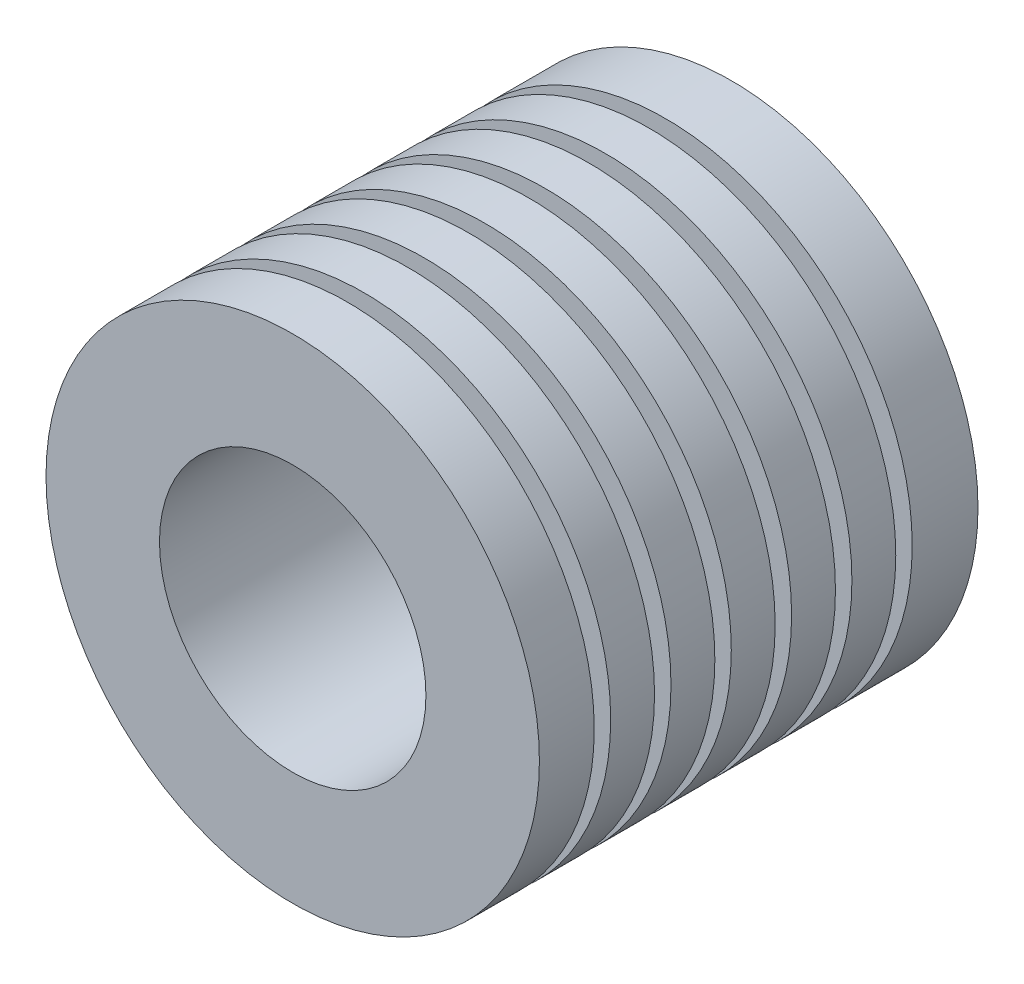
ISO-10303-21;
HEADER;
FILE_DESCRIPTION(('STEP AP214'),'2;1');
FILE_NAME('part.step','',(''),(''),'','','');
FILE_SCHEMA(('AUTOMOTIVE_DESIGN { 1 0 10303 214 1 1 1 1 }'));
ENDSEC;
DATA;
#1=APPLICATION_CONTEXT('core data for automotive mechanical design processes');
#2=APPLICATION_PROTOCOL_DEFINITION('international standard','automotive_design',2000,#1);
#3=PRODUCT_CONTEXT('',#1,'mechanical');
#4=PRODUCT('Part','Part','',(#3));
#5=PRODUCT_RELATED_PRODUCT_CATEGORY('part','',(#4));
#6=PRODUCT_DEFINITION_FORMATION('','',#4);
#7=PRODUCT_DEFINITION_CONTEXT('part definition',#1,'design');
#8=PRODUCT_DEFINITION('design','',#6,#7);
#9=PRODUCT_DEFINITION_SHAPE('','',#8);
#10=(LENGTH_UNIT() NAMED_UNIT(*) SI_UNIT(.MILLI.,.METRE.));
#11=(NAMED_UNIT(*) PLANE_ANGLE_UNIT() SI_UNIT($,.RADIAN.));
#12=(NAMED_UNIT(*) SI_UNIT($,.STERADIAN.) SOLID_ANGLE_UNIT());
#13=UNCERTAINTY_MEASURE_WITH_UNIT(LENGTH_MEASURE(1.E-05),#10,'distance_accuracy_value','');
#14=(GEOMETRIC_REPRESENTATION_CONTEXT(3) GLOBAL_UNCERTAINTY_ASSIGNED_CONTEXT((#13)) GLOBAL_UNIT_ASSIGNED_CONTEXT((#10,
#11,#12)) REPRESENTATION_CONTEXT('',''));
#15=CARTESIAN_POINT('',(0.,0.,0.));
#16=DIRECTION('',(0.,0.,1.));
#17=DIRECTION('',(1.,0.,0.));
#18=AXIS2_PLACEMENT_3D('',#15,#16,#17);
#19=CARTESIAN_POINT('',(0.,0.,40.));
#20=DIRECTION('',(0.,0.,-1.));
#21=DIRECTION('',(-1.,0.,0.));
#22=AXIS2_PLACEMENT_3D('',#19,#20,#21);
#23=CYLINDRICAL_SURFACE('',#22,22.5);
#24=CARTESIAN_POINT('',(0.,0.,7.50000000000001));
#25=DIRECTION('',(0.,0.,1.));
#26=DIRECTION('',(1.,0.,0.));
#27=AXIS2_PLACEMENT_3D('',#24,#25,#26);
#28=CIRCLE('',#27,22.5);
#29=CARTESIAN_POINT('',(22.5,0.,7.50000000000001));
#30=VERTEX_POINT('',#29);
#31=EDGE_CURVE('E38',#30,#30,#28,.T.);
#32=ORIENTED_EDGE('',*,*,#31,.T.);
#33=EDGE_LOOP('',(#32));
#34=FACE_BOUND('',#33,.T.);
#35=CARTESIAN_POINT('',(0.,0.,11.5));
#36=DIRECTION('',(0.,0.,-1.));
#37=DIRECTION('',(-1.,0.,0.));
#38=AXIS2_PLACEMENT_3D('',#35,#36,#37);
#39=CIRCLE('',#38,22.5);
#40=CARTESIAN_POINT('',(-22.5,0.,11.5));
#41=VERTEX_POINT('',#40);
#42=EDGE_CURVE('E84',#41,#41,#39,.T.);
#43=ORIENTED_EDGE('',*,*,#42,.T.);
#44=EDGE_LOOP('',(#43));
#45=FACE_BOUND('',#44,.T.);
#46=ADVANCED_FACE('F34',(#34,#45),#23,.T.);
#47=CARTESIAN_POINT('',(0.,0.,13.));
#48=DIRECTION('',(0.,0.,1.));
#49=DIRECTION('',(1.,0.,0.));
#50=AXIS2_PLACEMENT_3D('',#47,#48,#49);
#51=CIRCLE('',#50,22.5);
#52=CARTESIAN_POINT('',(22.5,0.,13.));
#53=VERTEX_POINT('',#52);
#54=EDGE_CURVE('E87',#53,#53,#51,.T.);
#55=ORIENTED_EDGE('',*,*,#54,.T.);
#56=EDGE_LOOP('',(#55));
#57=FACE_BOUND('',#56,.T.);
#58=CARTESIAN_POINT('',(0.,0.,17.));
#59=DIRECTION('',(0.,0.,-1.));
#60=DIRECTION('',(-1.,0.,0.));
#61=AXIS2_PLACEMENT_3D('',#58,#59,#60);
#62=CIRCLE('',#61,22.5);
#63=CARTESIAN_POINT('',(-22.5,0.,17.));
#64=VERTEX_POINT('',#63);
#65=EDGE_CURVE('E76',#64,#64,#62,.T.);
#66=ORIENTED_EDGE('',*,*,#65,.T.);
#67=EDGE_LOOP('',(#66));
#68=FACE_BOUND('',#67,.T.);
#69=ADVANCED_FACE('F151',(#57,#68),#23,.T.);
#70=CARTESIAN_POINT('',(0.,0.,18.5));
#71=DIRECTION('',(0.,0.,1.));
#72=DIRECTION('',(1.,0.,0.));
#73=AXIS2_PLACEMENT_3D('',#70,#71,#72);
#74=CIRCLE('',#73,22.5);
#75=CARTESIAN_POINT('',(22.5,0.,18.5));
#76=VERTEX_POINT('',#75);
#77=EDGE_CURVE('E79',#76,#76,#74,.T.);
#78=ORIENTED_EDGE('',*,*,#77,.T.);
#79=EDGE_LOOP('',(#78));
#80=FACE_BOUND('',#79,.T.);
#81=CARTESIAN_POINT('',(0.,0.,22.5));
#82=DIRECTION('',(0.,0.,-1.));
#83=DIRECTION('',(-1.,0.,0.));
#84=AXIS2_PLACEMENT_3D('',#81,#82,#83);
#85=CIRCLE('',#84,22.5);
#86=CARTESIAN_POINT('',(-22.5,0.,22.5));
#87=VERTEX_POINT('',#86);
#88=EDGE_CURVE('E68',#87,#87,#85,.T.);
#89=ORIENTED_EDGE('',*,*,#88,.T.);
#90=EDGE_LOOP('',(#89));
#91=FACE_BOUND('',#90,.T.);
#92=ADVANCED_FACE('F156',(#80,#91),#23,.T.);
#93=CARTESIAN_POINT('',(0.,0.,24.));
#94=DIRECTION('',(0.,0.,1.));
#95=DIRECTION('',(1.,0.,0.));
#96=AXIS2_PLACEMENT_3D('',#93,#94,#95);
#97=CIRCLE('',#96,22.5);
#98=CARTESIAN_POINT('',(22.5,0.,24.));
#99=VERTEX_POINT('',#98);
#100=EDGE_CURVE('E71',#99,#99,#97,.T.);
#101=ORIENTED_EDGE('',*,*,#100,.T.);
#102=EDGE_LOOP('',(#101));
#103=FACE_BOUND('',#102,.T.);
#104=CARTESIAN_POINT('',(0.,0.,28.));
#105=DIRECTION('',(0.,0.,-1.));
#106=DIRECTION('',(-1.,0.,0.));
#107=AXIS2_PLACEMENT_3D('',#104,#105,#106);
#108=CIRCLE('',#107,22.5);
#109=CARTESIAN_POINT('',(-22.5,0.,28.));
#110=VERTEX_POINT('',#109);
#111=EDGE_CURVE('E60',#110,#110,#108,.T.);
#112=ORIENTED_EDGE('',*,*,#111,.T.);
#113=EDGE_LOOP('',(#112));
#114=FACE_BOUND('',#113,.T.);
#115=ADVANCED_FACE('F173',(#103,#114),#23,.T.);
#116=CARTESIAN_POINT('',(0.,0.,29.5));
#117=DIRECTION('',(0.,0.,1.));
#118=DIRECTION('',(1.,0.,0.));
#119=AXIS2_PLACEMENT_3D('',#116,#117,#118);
#120=CIRCLE('',#119,22.5);
#121=CARTESIAN_POINT('',(22.5,0.,29.5));
#122=VERTEX_POINT('',#121);
#123=EDGE_CURVE('E63',#122,#122,#120,.T.);
#124=ORIENTED_EDGE('',*,*,#123,.T.);
#125=EDGE_LOOP('',(#124));
#126=FACE_BOUND('',#125,.T.);
#127=CARTESIAN_POINT('',(0.,0.,33.5));
#128=DIRECTION('',(0.,0.,-1.));
#129=DIRECTION('',(-1.,0.,0.));
#130=AXIS2_PLACEMENT_3D('',#127,#128,#129);
#131=CIRCLE('',#130,22.5);
#132=CARTESIAN_POINT('',(-22.5,0.,33.5));
#133=VERTEX_POINT('',#132);
#134=EDGE_CURVE('E52',#133,#133,#131,.T.);
#135=ORIENTED_EDGE('',*,*,#134,.T.);
#136=EDGE_LOOP('',(#135));
#137=FACE_BOUND('',#136,.T.);
#138=ADVANCED_FACE('F166',(#126,#137),#23,.T.);
#139=CARTESIAN_POINT('',(0.,0.,35.));
#140=DIRECTION('',(0.,0.,1.));
#141=DIRECTION('',(1.,0.,0.));
#142=AXIS2_PLACEMENT_3D('',#139,#140,#141);
#143=CIRCLE('',#142,22.5);
#144=CARTESIAN_POINT('',(22.5,0.,35.));
#145=VERTEX_POINT('',#144);
#146=EDGE_CURVE('E55',#145,#145,#143,.T.);
#147=ORIENTED_EDGE('',*,*,#146,.T.);
#148=EDGE_LOOP('',(#147));
#149=FACE_BOUND('',#148,.T.);
#150=CARTESIAN_POINT('',(0.,0.,40.));
#151=DIRECTION('',(0.,0.,1.));
#152=DIRECTION('',(1.,0.,0.));
#153=AXIS2_PLACEMENT_3D('',#150,#151,#152);
#154=CIRCLE('',#153,22.5);
#155=CARTESIAN_POINT('',(22.5,0.,40.));
#156=VERTEX_POINT('',#155);
#157=EDGE_CURVE('E10',#156,#156,#154,.T.);
#158=ORIENTED_EDGE('',*,*,#157,.F.);
#159=EDGE_LOOP('',(#158));
#160=FACE_BOUND('',#159,.T.);
#161=ADVANCED_FACE('F160',(#149,#160),#23,.T.);
#162=CARTESIAN_POINT('',(0.,0.,6.00000000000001));
#163=DIRECTION('',(0.,0.,-1.));
#164=DIRECTION('',(-1.,0.,0.));
#165=AXIS2_PLACEMENT_3D('',#162,#163,#164);
#166=CIRCLE('',#165,22.5);
#167=CARTESIAN_POINT('',(-22.5,0.,6.00000000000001));
#168=VERTEX_POINT('',#167);
#169=EDGE_CURVE('E91',#168,#168,#166,.T.);
#170=ORIENTED_EDGE('',*,*,#169,.T.);
#171=EDGE_LOOP('',(#170));
#172=FACE_BOUND('',#171,.T.);
#173=CARTESIAN_POINT('',(0.,0.,0.));
#174=DIRECTION('',(0.,0.,1.));
#175=DIRECTION('',(1.,0.,0.));
#176=AXIS2_PLACEMENT_3D('',#173,#174,#175);
#177=CIRCLE('',#176,22.5);
#178=CARTESIAN_POINT('',(22.5,0.,0.));
#179=VERTEX_POINT('',#178);
#180=EDGE_CURVE('E42',#179,#179,#177,.T.);
#181=ORIENTED_EDGE('',*,*,#180,.T.);
#182=EDGE_LOOP('',(#181));
#183=FACE_BOUND('',#182,.T.);
#184=ADVANCED_FACE('F36',(#172,#183),#23,.T.);
#185=CARTESIAN_POINT('',(0.,0.,40.));
#186=DIRECTION('',(0.,0.,1.));
#187=DIRECTION('',(1.,0.,0.));
#188=AXIS2_PLACEMENT_3D('',#185,#186,#187);
#189=PLANE('',#188);
#190=CARTESIAN_POINT('',(0.,0.,40.));
#191=DIRECTION('',(0.,0.,1.));
#192=DIRECTION('',(1.,0.,0.));
#193=AXIS2_PLACEMENT_3D('',#190,#191,#192);
#194=CIRCLE('',#193,12.15);
#195=CARTESIAN_POINT('',(12.15,0.,40.));
#196=VERTEX_POINT('',#195);
#197=EDGE_CURVE('E59',#196,#196,#194,.T.);
#198=ORIENTED_EDGE('',*,*,#197,.F.);
#199=EDGE_LOOP('',(#198));
#200=FACE_BOUND('',#199,.T.);
#201=ORIENTED_EDGE('',*,*,#157,.T.);
#202=EDGE_LOOP('',(#201));
#203=FACE_BOUND('',#202,.T.);
#204=ADVANCED_FACE('F147',(#200,#203),#189,.T.);
#205=CARTESIAN_POINT('',(0.,0.,0.));
#206=DIRECTION('',(0.,0.,1.));
#207=DIRECTION('',(1.,0.,0.));
#208=AXIS2_PLACEMENT_3D('',#205,#206,#207);
#209=PLANE('',#208);
#210=CARTESIAN_POINT('',(8.99999999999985,-15.58845726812,0.));
#211=DIRECTION('',(0.,0.,-1.));
#212=DIRECTION('',(-1.,0.,0.));
#213=AXIS2_PLACEMENT_3D('',#210,#211,#212);
#214=CIRCLE('',#213,1.24999999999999);
#215=CARTESIAN_POINT('',(7.74999999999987,-15.58845726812,0.));
#216=VERTEX_POINT('',#215);
#217=EDGE_CURVE('E275',#216,#216,#214,.T.);
#218=ORIENTED_EDGE('',*,*,#217,.F.);
#219=EDGE_LOOP('',(#218));
#220=FACE_BOUND('',#219,.T.);
#221=CARTESIAN_POINT('',(9.00000000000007,15.5884572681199,0.));
#222=DIRECTION('',(0.,0.,-1.));
#223=DIRECTION('',(-1.,0.,0.));
#224=AXIS2_PLACEMENT_3D('',#221,#222,#223);
#225=CIRCLE('',#224,1.24999999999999);
#226=CARTESIAN_POINT('',(7.75000000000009,15.5884572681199,0.));
#227=VERTEX_POINT('',#226);
#228=EDGE_CURVE('E277',#227,#227,#225,.T.);
#229=ORIENTED_EDGE('',*,*,#228,.F.);
#230=EDGE_LOOP('',(#229));
#231=FACE_BOUND('',#230,.T.);
#232=CARTESIAN_POINT('',(-18.,0.,0.));
#233=DIRECTION('',(0.,0.,-1.));
#234=DIRECTION('',(-1.,0.,0.));
#235=AXIS2_PLACEMENT_3D('',#232,#233,#234);
#236=CIRCLE('',#235,1.24999999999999);
#237=CARTESIAN_POINT('',(-19.25,0.,0.));
#238=VERTEX_POINT('',#237);
#239=EDGE_CURVE('E285',#238,#238,#236,.T.);
#240=ORIENTED_EDGE('',*,*,#239,.F.);
#241=EDGE_LOOP('',(#240));
#242=FACE_BOUND('',#241,.T.);
#243=CARTESIAN_POINT('',(0.,0.,0.));
#244=DIRECTION('',(0.,0.,1.));
#245=DIRECTION('',(1.,0.,0.));
#246=AXIS2_PLACEMENT_3D('',#243,#244,#245);
#247=CIRCLE('',#246,12.15);
#248=CARTESIAN_POINT('',(12.15,0.,0.));
#249=VERTEX_POINT('',#248);
#250=EDGE_CURVE('E47',#249,#249,#247,.T.);
#251=ORIENTED_EDGE('',*,*,#250,.T.);
#252=EDGE_LOOP('',(#251));
#253=FACE_BOUND('',#252,.T.);
#254=ORIENTED_EDGE('',*,*,#180,.F.);
#255=EDGE_LOOP('',(#254));
#256=FACE_BOUND('',#255,.T.);
#257=ADVANCED_FACE('F133',(#220,#231,#242,#253,#256),#209,.F.);
#258=CARTESIAN_POINT('',(0.,0.,40.));
#259=DIRECTION('',(0.,0.,1.));
#260=DIRECTION('',(1.,0.,0.));
#261=AXIS2_PLACEMENT_3D('',#258,#259,#260);
#262=CYLINDRICAL_SURFACE('',#261,12.15);
#263=ORIENTED_EDGE('',*,*,#250,.F.);
#264=EDGE_LOOP('',(#263));
#265=FACE_BOUND('',#264,.T.);
#266=ORIENTED_EDGE('',*,*,#197,.T.);
#267=EDGE_LOOP('',(#266));
#268=FACE_BOUND('',#267,.T.);
#269=ADVANCED_FACE('F136',(#265,#268),#262,.F.);
#270=CARTESIAN_POINT('',(0.,25.,35.));
#271=DIRECTION('',(0.,0.,1.));
#272=DIRECTION('',(1.,0.,0.));
#273=AXIS2_PLACEMENT_3D('',#270,#271,#272);
#274=PLANE('',#273);
#275=CARTESIAN_POINT('',(0.,0.,35.));
#276=DIRECTION('',(0.,0.,-1.));
#277=DIRECTION('',(-1.,0.,0.));
#278=AXIS2_PLACEMENT_3D('',#275,#276,#277);
#279=CIRCLE('',#278,15.);
#280=CARTESIAN_POINT('',(-15.,0.,35.));
#281=VERTEX_POINT('',#280);
#282=EDGE_CURVE('E56',#281,#281,#279,.T.);
#283=ORIENTED_EDGE('',*,*,#282,.F.);
#284=EDGE_LOOP('',(#283));
#285=FACE_BOUND('',#284,.T.);
#286=ORIENTED_EDGE('',*,*,#146,.F.);
#287=EDGE_LOOP('',(#286));
#288=FACE_BOUND('',#287,.T.);
#289=ADVANCED_FACE('F138',(#285,#288),#274,.F.);
#290=CARTESIAN_POINT('',(0.,25.,33.5));
#291=DIRECTION('',(0.,0.,-1.));
#292=DIRECTION('',(-1.,0.,0.));
#293=AXIS2_PLACEMENT_3D('',#290,#291,#292);
#294=PLANE('',#293);
#295=CARTESIAN_POINT('',(0.,0.,33.5));
#296=DIRECTION('',(0.,0.,-1.));
#297=DIRECTION('',(-1.,0.,0.));
#298=AXIS2_PLACEMENT_3D('',#295,#296,#297);
#299=CIRCLE('',#298,15.);
#300=CARTESIAN_POINT('',(-15.,0.,33.5));
#301=VERTEX_POINT('',#300);
#302=EDGE_CURVE('E67',#301,#301,#299,.T.);
#303=ORIENTED_EDGE('',*,*,#302,.T.);
#304=EDGE_LOOP('',(#303));
#305=FACE_BOUND('',#304,.T.);
#306=ORIENTED_EDGE('',*,*,#134,.F.);
#307=EDGE_LOOP('',(#306));
#308=FACE_BOUND('',#307,.T.);
#309=ADVANCED_FACE('F144',(#305,#308),#294,.F.);
#310=CARTESIAN_POINT('',(0.,0.,-13.4445377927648));
#311=DIRECTION('',(0.,0.,-1.));
#312=DIRECTION('',(-1.,0.,0.));
#313=AXIS2_PLACEMENT_3D('',#310,#311,#312);
#314=CYLINDRICAL_SURFACE('',#313,15.);
#315=ORIENTED_EDGE('',*,*,#302,.F.);
#316=EDGE_LOOP('',(#315));
#317=FACE_BOUND('',#316,.T.);
#318=ORIENTED_EDGE('',*,*,#282,.T.);
#319=EDGE_LOOP('',(#318));
#320=FACE_BOUND('',#319,.T.);
#321=ADVANCED_FACE('F187',(#317,#320),#314,.T.);
#322=CARTESIAN_POINT('',(0.,25.,29.5));
#323=DIRECTION('',(0.,0.,1.));
#324=DIRECTION('',(1.,0.,0.));
#325=AXIS2_PLACEMENT_3D('',#322,#323,#324);
#326=PLANE('',#325);
#327=CARTESIAN_POINT('',(0.,0.,29.5));
#328=DIRECTION('',(0.,0.,-1.));
#329=DIRECTION('',(-1.,0.,0.));
#330=AXIS2_PLACEMENT_3D('',#327,#328,#329);
#331=CIRCLE('',#330,15.);
#332=CARTESIAN_POINT('',(-15.,0.,29.5));
#333=VERTEX_POINT('',#332);
#334=EDGE_CURVE('E64',#333,#333,#331,.T.);
#335=ORIENTED_EDGE('',*,*,#334,.F.);
#336=EDGE_LOOP('',(#335));
#337=FACE_BOUND('',#336,.T.);
#338=ORIENTED_EDGE('',*,*,#123,.F.);
#339=EDGE_LOOP('',(#338));
#340=FACE_BOUND('',#339,.T.);
#341=ADVANCED_FACE('F193',(#337,#340),#326,.F.);
#342=CARTESIAN_POINT('',(0.,25.,28.));
#343=DIRECTION('',(0.,0.,-1.));
#344=DIRECTION('',(-1.,0.,0.));
#345=AXIS2_PLACEMENT_3D('',#342,#343,#344);
#346=PLANE('',#345);
#347=CARTESIAN_POINT('',(0.,0.,28.));
#348=DIRECTION('',(0.,0.,-1.));
#349=DIRECTION('',(-1.,0.,0.));
#350=AXIS2_PLACEMENT_3D('',#347,#348,#349);
#351=CIRCLE('',#350,15.);
#352=CARTESIAN_POINT('',(-15.,0.,28.));
#353=VERTEX_POINT('',#352);
#354=EDGE_CURVE('E75',#353,#353,#351,.T.);
#355=ORIENTED_EDGE('',*,*,#354,.T.);
#356=EDGE_LOOP('',(#355));
#357=FACE_BOUND('',#356,.T.);
#358=ORIENTED_EDGE('',*,*,#111,.F.);
#359=EDGE_LOOP('',(#358));
#360=FACE_BOUND('',#359,.T.);
#361=ADVANCED_FACE('F199',(#357,#360),#346,.F.);
#362=CARTESIAN_POINT('',(0.,0.,-18.9445377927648));
#363=DIRECTION('',(0.,0.,-1.));
#364=DIRECTION('',(-1.,0.,0.));
#365=AXIS2_PLACEMENT_3D('',#362,#363,#364);
#366=CYLINDRICAL_SURFACE('',#365,15.);
#367=ORIENTED_EDGE('',*,*,#354,.F.);
#368=EDGE_LOOP('',(#367));
#369=FACE_BOUND('',#368,.T.);
#370=ORIENTED_EDGE('',*,*,#334,.T.);
#371=EDGE_LOOP('',(#370));
#372=FACE_BOUND('',#371,.T.);
#373=ADVANCED_FACE('F201',(#369,#372),#366,.T.);
#374=CARTESIAN_POINT('',(0.,25.,24.));
#375=DIRECTION('',(0.,0.,1.));
#376=DIRECTION('',(1.,0.,0.));
#377=AXIS2_PLACEMENT_3D('',#374,#375,#376);
#378=PLANE('',#377);
#379=CARTESIAN_POINT('',(0.,0.,24.));
#380=DIRECTION('',(0.,0.,-1.));
#381=DIRECTION('',(-1.,0.,0.));
#382=AXIS2_PLACEMENT_3D('',#379,#380,#381);
#383=CIRCLE('',#382,15.);
#384=CARTESIAN_POINT('',(-15.,0.,24.));
#385=VERTEX_POINT('',#384);
#386=EDGE_CURVE('E72',#385,#385,#383,.T.);
#387=ORIENTED_EDGE('',*,*,#386,.F.);
#388=EDGE_LOOP('',(#387));
#389=FACE_BOUND('',#388,.T.);
#390=ORIENTED_EDGE('',*,*,#100,.F.);
#391=EDGE_LOOP('',(#390));
#392=FACE_BOUND('',#391,.T.);
#393=ADVANCED_FACE('F204',(#389,#392),#378,.F.);
#394=CARTESIAN_POINT('',(0.,25.,22.5));
#395=DIRECTION('',(0.,0.,-1.));
#396=DIRECTION('',(-1.,0.,0.));
#397=AXIS2_PLACEMENT_3D('',#394,#395,#396);
#398=PLANE('',#397);
#399=CARTESIAN_POINT('',(0.,0.,22.5));
#400=DIRECTION('',(0.,0.,-1.));
#401=DIRECTION('',(-1.,0.,0.));
#402=AXIS2_PLACEMENT_3D('',#399,#400,#401);
#403=CIRCLE('',#402,15.);
#404=CARTESIAN_POINT('',(-15.,0.,22.5));
#405=VERTEX_POINT('',#404);
#406=EDGE_CURVE('E83',#405,#405,#403,.T.);
#407=ORIENTED_EDGE('',*,*,#406,.T.);
#408=EDGE_LOOP('',(#407));
#409=FACE_BOUND('',#408,.T.);
#410=ORIENTED_EDGE('',*,*,#88,.F.);
#411=EDGE_LOOP('',(#410));
#412=FACE_BOUND('',#411,.T.);
#413=ADVANCED_FACE('F211',(#409,#412),#398,.F.);
#414=CARTESIAN_POINT('',(0.,0.,-24.4445377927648));
#415=DIRECTION('',(0.,0.,-1.));
#416=DIRECTION('',(-1.,0.,0.));
#417=AXIS2_PLACEMENT_3D('',#414,#415,#416);
#418=CYLINDRICAL_SURFACE('',#417,15.);
#419=ORIENTED_EDGE('',*,*,#406,.F.);
#420=EDGE_LOOP('',(#419));
#421=FACE_BOUND('',#420,.T.);
#422=ORIENTED_EDGE('',*,*,#386,.T.);
#423=EDGE_LOOP('',(#422));
#424=FACE_BOUND('',#423,.T.);
#425=ADVANCED_FACE('F213',(#421,#424),#418,.T.);
#426=CARTESIAN_POINT('',(0.,25.,18.5));
#427=DIRECTION('',(0.,0.,1.));
#428=DIRECTION('',(1.,0.,0.));
#429=AXIS2_PLACEMENT_3D('',#426,#427,#428);
#430=PLANE('',#429);
#431=CARTESIAN_POINT('',(0.,0.,18.5));
#432=DIRECTION('',(0.,0.,-1.));
#433=DIRECTION('',(-1.,0.,0.));
#434=AXIS2_PLACEMENT_3D('',#431,#432,#433);
#435=CIRCLE('',#434,15.);
#436=CARTESIAN_POINT('',(-15.,0.,18.5));
#437=VERTEX_POINT('',#436);
#438=EDGE_CURVE('E80',#437,#437,#435,.T.);
#439=ORIENTED_EDGE('',*,*,#438,.F.);
#440=EDGE_LOOP('',(#439));
#441=FACE_BOUND('',#440,.T.);
#442=ORIENTED_EDGE('',*,*,#77,.F.);
#443=EDGE_LOOP('',(#442));
#444=FACE_BOUND('',#443,.T.);
#445=ADVANCED_FACE('F216',(#441,#444),#430,.F.);
#446=CARTESIAN_POINT('',(0.,25.,17.));
#447=DIRECTION('',(0.,0.,-1.));
#448=DIRECTION('',(-1.,0.,0.));
#449=AXIS2_PLACEMENT_3D('',#446,#447,#448);
#450=PLANE('',#449);
#451=CARTESIAN_POINT('',(0.,0.,17.));
#452=DIRECTION('',(0.,0.,-1.));
#453=DIRECTION('',(-1.,0.,0.));
#454=AXIS2_PLACEMENT_3D('',#451,#452,#453);
#455=CIRCLE('',#454,15.);
#456=CARTESIAN_POINT('',(-15.,0.,17.));
#457=VERTEX_POINT('',#456);
#458=EDGE_CURVE('E90',#457,#457,#455,.T.);
#459=ORIENTED_EDGE('',*,*,#458,.T.);
#460=EDGE_LOOP('',(#459));
#461=FACE_BOUND('',#460,.T.);
#462=ORIENTED_EDGE('',*,*,#65,.F.);
#463=EDGE_LOOP('',(#462));
#464=FACE_BOUND('',#463,.T.);
#465=ADVANCED_FACE('F223',(#461,#464),#450,.F.);
#466=CARTESIAN_POINT('',(0.,0.,-29.9445377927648));
#467=DIRECTION('',(0.,0.,-1.));
#468=DIRECTION('',(-1.,0.,0.));
#469=AXIS2_PLACEMENT_3D('',#466,#467,#468);
#470=CYLINDRICAL_SURFACE('',#469,15.);
#471=ORIENTED_EDGE('',*,*,#458,.F.);
#472=EDGE_LOOP('',(#471));
#473=FACE_BOUND('',#472,.T.);
#474=ORIENTED_EDGE('',*,*,#438,.T.);
#475=EDGE_LOOP('',(#474));
#476=FACE_BOUND('',#475,.T.);
#477=ADVANCED_FACE('F225',(#473,#476),#470,.T.);
#478=CARTESIAN_POINT('',(0.,25.,13.));
#479=DIRECTION('',(0.,0.,1.));
#480=DIRECTION('',(1.,0.,0.));
#481=AXIS2_PLACEMENT_3D('',#478,#479,#480);
#482=PLANE('',#481);
#483=CARTESIAN_POINT('',(0.,0.,13.));
#484=DIRECTION('',(0.,0.,-1.));
#485=DIRECTION('',(-1.,0.,0.));
#486=AXIS2_PLACEMENT_3D('',#483,#484,#485);
#487=CIRCLE('',#486,15.);
#488=CARTESIAN_POINT('',(-15.,0.,13.));
#489=VERTEX_POINT('',#488);
#490=EDGE_CURVE('E88',#489,#489,#487,.T.);
#491=ORIENTED_EDGE('',*,*,#490,.F.);
#492=EDGE_LOOP('',(#491));
#493=FACE_BOUND('',#492,.T.);
#494=ORIENTED_EDGE('',*,*,#54,.F.);
#495=EDGE_LOOP('',(#494));
#496=FACE_BOUND('',#495,.T.);
#497=ADVANCED_FACE('F228',(#493,#496),#482,.F.);
#498=CARTESIAN_POINT('',(0.,25.,11.5));
#499=DIRECTION('',(0.,0.,-1.));
#500=DIRECTION('',(-1.,0.,0.));
#501=AXIS2_PLACEMENT_3D('',#498,#499,#500);
#502=PLANE('',#501);
#503=CARTESIAN_POINT('',(0.,0.,11.5));
#504=DIRECTION('',(0.,0.,-1.));
#505=DIRECTION('',(-1.,0.,0.));
#506=AXIS2_PLACEMENT_3D('',#503,#504,#505);
#507=CIRCLE('',#506,15.);
#508=CARTESIAN_POINT('',(-15.,0.,11.5));
#509=VERTEX_POINT('',#508);
#510=EDGE_CURVE('E97',#509,#509,#507,.T.);
#511=ORIENTED_EDGE('',*,*,#510,.T.);
#512=EDGE_LOOP('',(#511));
#513=FACE_BOUND('',#512,.T.);
#514=ORIENTED_EDGE('',*,*,#42,.F.);
#515=EDGE_LOOP('',(#514));
#516=FACE_BOUND('',#515,.T.);
#517=ADVANCED_FACE('F235',(#513,#516),#502,.F.);
#518=CARTESIAN_POINT('',(0.,0.,-35.4445377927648));
#519=DIRECTION('',(0.,0.,-1.));
#520=DIRECTION('',(-1.,0.,0.));
#521=AXIS2_PLACEMENT_3D('',#518,#519,#520);
#522=CYLINDRICAL_SURFACE('',#521,15.);
#523=ORIENTED_EDGE('',*,*,#510,.F.);
#524=EDGE_LOOP('',(#523));
#525=FACE_BOUND('',#524,.T.);
#526=ORIENTED_EDGE('',*,*,#490,.T.);
#527=EDGE_LOOP('',(#526));
#528=FACE_BOUND('',#527,.T.);
#529=ADVANCED_FACE('F237',(#525,#528),#522,.T.);
#530=CARTESIAN_POINT('',(0.,25.,7.50000000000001));
#531=DIRECTION('',(0.,0.,1.));
#532=DIRECTION('',(1.,0.,0.));
#533=AXIS2_PLACEMENT_3D('',#530,#531,#532);
#534=PLANE('',#533);
#535=CARTESIAN_POINT('',(0.,0.,7.50000000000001));
#536=DIRECTION('',(0.,0.,-1.));
#537=DIRECTION('',(-1.,0.,0.));
#538=AXIS2_PLACEMENT_3D('',#535,#536,#537);
#539=CIRCLE('',#538,15.);
#540=CARTESIAN_POINT('',(-15.,0.,7.50000000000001));
#541=VERTEX_POINT('',#540);
#542=EDGE_CURVE('E93',#541,#541,#539,.T.);
#543=ORIENTED_EDGE('',*,*,#542,.F.);
#544=EDGE_LOOP('',(#543));
#545=FACE_BOUND('',#544,.T.);
#546=ORIENTED_EDGE('',*,*,#31,.F.);
#547=EDGE_LOOP('',(#546));
#548=FACE_BOUND('',#547,.T.);
#549=ADVANCED_FACE('F240',(#545,#548),#534,.F.);
#550=CARTESIAN_POINT('',(0.,25.,6.00000000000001));
#551=DIRECTION('',(0.,0.,-1.));
#552=DIRECTION('',(-1.,0.,0.));
#553=AXIS2_PLACEMENT_3D('',#550,#551,#552);
#554=PLANE('',#553);
#555=CARTESIAN_POINT('',(8.99999999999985,-15.58845726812,6.00000000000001));
#556=DIRECTION('',(0.,0.,-1.));
#557=DIRECTION('',(-1.,0.,0.));
#558=AXIS2_PLACEMENT_3D('',#555,#556,#557);
#559=CIRCLE('',#558,1.24999999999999);
#560=CARTESIAN_POINT('',(7.74999999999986,-15.58845726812,6.00000000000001));
#561=VERTEX_POINT('',#560);
#562=EDGE_CURVE('E272',#561,#561,#559,.T.);
#563=ORIENTED_EDGE('',*,*,#562,.T.);
#564=EDGE_LOOP('',(#563));
#565=FACE_BOUND('',#564,.T.);
#566=CARTESIAN_POINT('',(9.00000000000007,15.5884572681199,6.00000000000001));
#567=DIRECTION('',(0.,0.,-1.));
#568=DIRECTION('',(-1.,0.,0.));
#569=AXIS2_PLACEMENT_3D('',#566,#567,#568);
#570=CIRCLE('',#569,1.24999999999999);
#571=CARTESIAN_POINT('',(7.75000000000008,15.5884572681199,6.00000000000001));
#572=VERTEX_POINT('',#571);
#573=EDGE_CURVE('E282',#572,#572,#570,.T.);
#574=ORIENTED_EDGE('',*,*,#573,.T.);
#575=EDGE_LOOP('',(#574));
#576=FACE_BOUND('',#575,.T.);
#577=CARTESIAN_POINT('',(-18.,0.,6.00000000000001));
#578=DIRECTION('',(0.,0.,-1.));
#579=DIRECTION('',(-1.,0.,0.));
#580=AXIS2_PLACEMENT_3D('',#577,#578,#579);
#581=CIRCLE('',#580,1.24999999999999);
#582=CARTESIAN_POINT('',(-19.25,0.,6.00000000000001));
#583=VERTEX_POINT('',#582);
#584=EDGE_CURVE('E104',#583,#583,#581,.T.);
#585=ORIENTED_EDGE('',*,*,#584,.T.);
#586=EDGE_LOOP('',(#585));
#587=FACE_BOUND('',#586,.T.);
#588=CARTESIAN_POINT('',(0.,0.,6.00000000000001));
#589=DIRECTION('',(0.,0.,-1.));
#590=DIRECTION('',(-1.,0.,0.));
#591=AXIS2_PLACEMENT_3D('',#588,#589,#590);
#592=CIRCLE('',#591,15.);
#593=CARTESIAN_POINT('',(-15.,0.,6.00000000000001));
#594=VERTEX_POINT('',#593);
#595=EDGE_CURVE('E99',#594,#594,#592,.T.);
#596=ORIENTED_EDGE('',*,*,#595,.T.);
#597=EDGE_LOOP('',(#596));
#598=FACE_BOUND('',#597,.T.);
#599=ORIENTED_EDGE('',*,*,#169,.F.);
#600=EDGE_LOOP('',(#599));
#601=FACE_BOUND('',#600,.T.);
#602=ADVANCED_FACE('F247',(#565,#576,#587,#598,#601),#554,.F.);
#603=CARTESIAN_POINT('',(0.,0.,-40.9445377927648));
#604=DIRECTION('',(0.,0.,-1.));
#605=DIRECTION('',(-1.,0.,0.));
#606=AXIS2_PLACEMENT_3D('',#603,#604,#605);
#607=CYLINDRICAL_SURFACE('',#606,15.);
#608=ORIENTED_EDGE('',*,*,#595,.F.);
#609=EDGE_LOOP('',(#608));
#610=FACE_BOUND('',#609,.T.);
#611=ORIENTED_EDGE('',*,*,#542,.T.);
#612=EDGE_LOOP('',(#611));
#613=FACE_BOUND('',#612,.T.);
#614=ADVANCED_FACE('F249',(#610,#613),#607,.T.);
#615=CARTESIAN_POINT('',(-18.,0.,0.));
#616=DIRECTION('',(0.,0.,-1.));
#617=DIRECTION('',(-1.,0.,0.));
#618=AXIS2_PLACEMENT_3D('',#615,#616,#617);
#619=CYLINDRICAL_SURFACE('',#618,1.24999999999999);
#620=ORIENTED_EDGE('',*,*,#584,.F.);
#621=EDGE_LOOP('',(#620));
#622=FACE_BOUND('',#621,.T.);
#623=ORIENTED_EDGE('',*,*,#239,.T.);
#624=EDGE_LOOP('',(#623));
#625=FACE_BOUND('',#624,.T.);
#626=ADVANCED_FACE('F252',(#622,#625),#619,.F.);
#627=CARTESIAN_POINT('',(9.00000000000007,15.5884572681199,0.));
#628=DIRECTION('',(0.,0.,-1.));
#629=DIRECTION('',(-1.,0.,0.));
#630=AXIS2_PLACEMENT_3D('',#627,#628,#629);
#631=CYLINDRICAL_SURFACE('',#630,1.24999999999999);
#632=ORIENTED_EDGE('',*,*,#573,.F.);
#633=EDGE_LOOP('',(#632));
#634=FACE_BOUND('',#633,.T.);
#635=ORIENTED_EDGE('',*,*,#228,.T.);
#636=EDGE_LOOP('',(#635));
#637=FACE_BOUND('',#636,.T.);
#638=ADVANCED_FACE('F259',(#634,#637),#631,.F.);
#639=CARTESIAN_POINT('',(8.99999999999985,-15.58845726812,0.));
#640=DIRECTION('',(0.,0.,-1.));
#641=DIRECTION('',(-1.,0.,0.));
#642=AXIS2_PLACEMENT_3D('',#639,#640,#641);
#643=CYLINDRICAL_SURFACE('',#642,1.24999999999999);
#644=ORIENTED_EDGE('',*,*,#562,.F.);
#645=EDGE_LOOP('',(#644));
#646=FACE_BOUND('',#645,.T.);
#647=ORIENTED_EDGE('',*,*,#217,.T.);
#648=EDGE_LOOP('',(#647));
#649=FACE_BOUND('',#648,.T.);
#650=ADVANCED_FACE('F263',(#646,#649),#643,.F.);
#651=CLOSED_SHELL('',(#46,#69,#92,#115,#138,#161,#184,#204,#257,#269,#289,#309,#321,#341,#361,
#373,#393,#413,#425,#445,#465,#477,#497,#517,#529,#549,#602,#614,#626,#638,#650));
#652=MANIFOLD_SOLID_BREP('B2',#651);
#653=ADVANCED_BREP_SHAPE_REPRESENTATION('',(#18,#652),#14);
#654=SHAPE_DEFINITION_REPRESENTATION(#9,#653);
ENDSEC;
END-ISO-10303-21;
